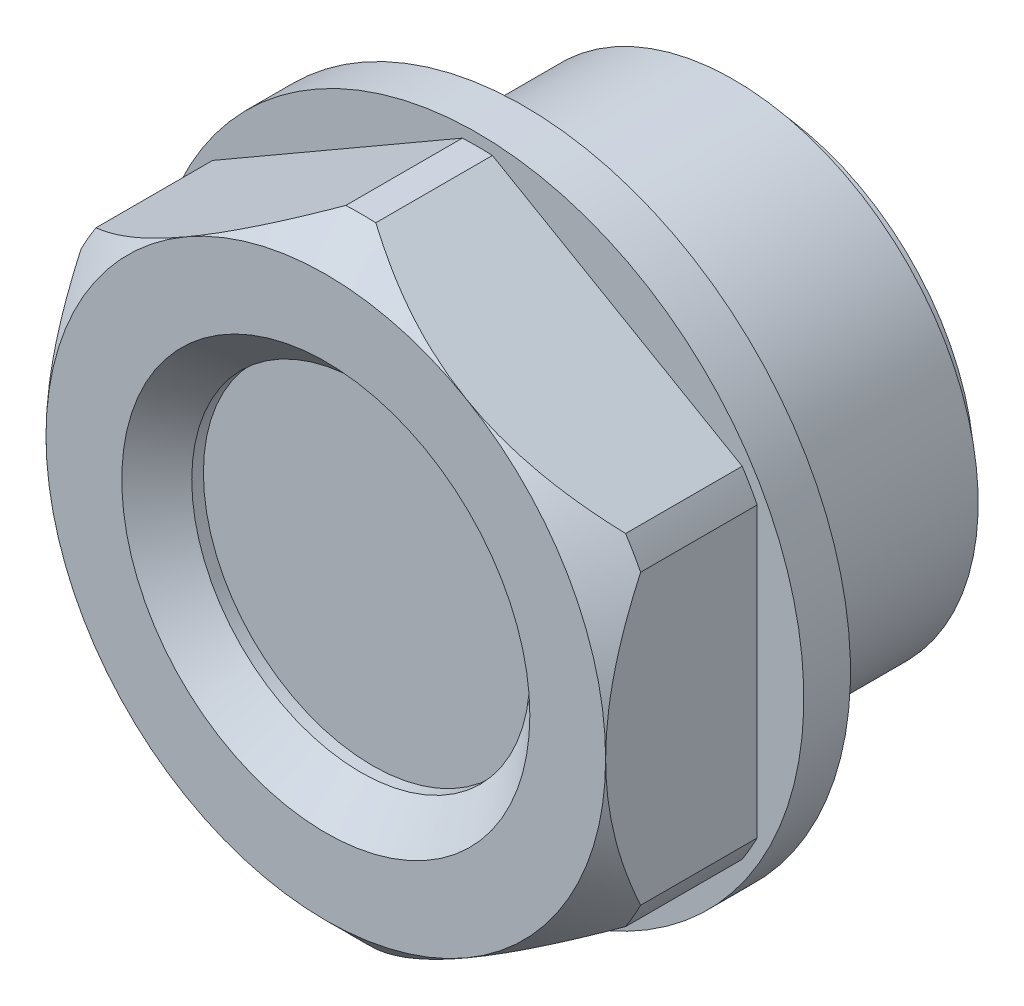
ISO-10303-21;
HEADER;
FILE_DESCRIPTION(('STEP AP214'),'2;1');
FILE_NAME('part.step','',(''),(''),'','','');
FILE_SCHEMA(('AUTOMOTIVE_DESIGN { 1 0 10303 214 1 1 1 1 }'));
ENDSEC;
DATA;
#1=APPLICATION_CONTEXT('core data for automotive mechanical design processes');
#2=APPLICATION_PROTOCOL_DEFINITION('international standard','automotive_design',2000,#1);
#3=PRODUCT_CONTEXT('',#1,'mechanical');
#4=PRODUCT('Part','Part','',(#3));
#5=PRODUCT_RELATED_PRODUCT_CATEGORY('part','',(#4));
#6=PRODUCT_DEFINITION_FORMATION('','',#4);
#7=PRODUCT_DEFINITION_CONTEXT('part definition',#1,'design');
#8=PRODUCT_DEFINITION('design','',#6,#7);
#9=PRODUCT_DEFINITION_SHAPE('','',#8);
#10=(LENGTH_UNIT() NAMED_UNIT(*) SI_UNIT(.MILLI.,.METRE.));
#11=(NAMED_UNIT(*) PLANE_ANGLE_UNIT() SI_UNIT($,.RADIAN.));
#12=(NAMED_UNIT(*) SI_UNIT($,.STERADIAN.) SOLID_ANGLE_UNIT());
#13=UNCERTAINTY_MEASURE_WITH_UNIT(LENGTH_MEASURE(1.E-05),#10,'distance_accuracy_value','');
#14=(GEOMETRIC_REPRESENTATION_CONTEXT(3) GLOBAL_UNCERTAINTY_ASSIGNED_CONTEXT((#13)) GLOBAL_UNIT_ASSIGNED_CONTEXT((#10,
#11,#12)) REPRESENTATION_CONTEXT('',''));
#15=CARTESIAN_POINT('',(0.,0.,0.));
#16=DIRECTION('',(0.,0.,1.));
#17=DIRECTION('',(1.,0.,0.));
#18=AXIS2_PLACEMENT_3D('',#15,#16,#17);
#19=CARTESIAN_POINT('',(0.,0.,0.));
#20=DIRECTION('',(0.,0.,-1.));
#21=DIRECTION('',(-1.,0.,0.));
#22=AXIS2_PLACEMENT_3D('',#19,#20,#21);
#23=CYLINDRICAL_SURFACE('',#22,13.4999999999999);
#24=CARTESIAN_POINT('',(1.50010212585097E-13,1.08246744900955E-13,3.00000000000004));
#25=DIRECTION('',(0.,0.,-1.));
#26=DIRECTION('',(-1.,0.,0.));
#27=AXIS2_PLACEMENT_3D('',#24,#25,#26);
#28=CIRCLE('',#27,13.5);
#29=CARTESIAN_POINT('',(-0.643928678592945,13.4846340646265,2.99999999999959));
#30=VERTEX_POINT('',#29);
#31=CARTESIAN_POINT('',(0.643928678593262,13.4846340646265,2.99999999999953));
#32=VERTEX_POINT('',#31);
#33=EDGE_CURVE('E139',#30,#32,#28,.T.);
#34=ORIENTED_EDGE('',*,*,#33,.F.);
#35=DIRECTION('',(0.,0.,-1.));
#36=VECTOR('',#35,1.);
#37=CARTESIAN_POINT('',(-0.643928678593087,13.4846340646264,-4.54357288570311E-13));
#38=LINE('',#37,#36);
#39=CARTESIAN_POINT('',(-0.643928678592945,13.4846340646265,7.99999999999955));
#40=VERTEX_POINT('',#39);
#41=EDGE_CURVE('E349',#30,#40,#38,.F.);
#42=ORIENTED_EDGE('',*,*,#41,.T.);
#43=CARTESIAN_POINT('',(4.00027233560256E-13,2.88657986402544E-13,8.));
#44=DIRECTION('',(0.,0.,-1.));
#45=DIRECTION('',(-1.,0.,0.));
#46=AXIS2_PLACEMENT_3D('',#43,#44,#45);
#47=CIRCLE('',#46,13.4999999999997);
#48=CARTESIAN_POINT('',(0.643928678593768,13.4846340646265,7.99999999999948));
#49=VERTEX_POINT('',#48);
#50=EDGE_CURVE('E141',#40,#49,#47,.T.);
#51=ORIENTED_EDGE('',*,*,#50,.T.);
#52=DIRECTION('',(0.,0.,-1.));
#53=VECTOR('',#52,1.);
#54=CARTESIAN_POINT('',(0.64392867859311,13.4846340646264,-5.18754540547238E-13));
#55=LINE('',#54,#53);
#56=EDGE_CURVE('E124',#49,#32,#55,.T.);
#57=ORIENTED_EDGE('',*,*,#56,.T.);
#58=EDGE_LOOP('',(#34,#42,#51,#57));
#59=FACE_BOUND('',#58,.T.);
#60=ADVANCED_FACE('F14',(#59),#23,.T.);
#61=CARTESIAN_POINT('',(-11.9999999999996,6.18465843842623,8.00000000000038));
#62=VERTEX_POINT('',#61);
#63=CARTESIAN_POINT('',(-11.3560713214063,7.29997562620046,8.0000000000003));
#64=VERTEX_POINT('',#63);
#65=EDGE_CURVE('E156',#62,#64,#47,.T.);
#66=ORIENTED_EDGE('',*,*,#65,.T.);
#67=DIRECTION('',(0.,0.,-1.));
#68=VECTOR('',#67,1.);
#69=CARTESIAN_POINT('',(-11.356071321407,7.29997562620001,3.04442691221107E-13));
#70=LINE('',#69,#68);
#71=CARTESIAN_POINT('',(-11.3560713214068,7.29997562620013,3.00000000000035));
#72=VERTEX_POINT('',#71);
#73=EDGE_CURVE('E347',#64,#72,#70,.T.);
#74=ORIENTED_EDGE('',*,*,#73,.T.);
#75=CARTESIAN_POINT('',(-11.9999999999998,6.18465843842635,3.00000000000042));
#76=VERTEX_POINT('',#75);
#77=EDGE_CURVE('E148',#76,#72,#28,.T.);
#78=ORIENTED_EDGE('',*,*,#77,.F.);
#79=DIRECTION('',(0.,0.,-1.));
#80=VECTOR('',#79,1.);
#81=CARTESIAN_POINT('',(-12.,6.18465843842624,3.76884468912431E-13));
#82=LINE('',#81,#80);
#83=EDGE_CURVE('E345',#76,#62,#82,.F.);
#84=ORIENTED_EDGE('',*,*,#83,.T.);
#85=EDGE_LOOP('',(#66,#74,#78,#84));
#86=FACE_BOUND('',#85,.T.);
#87=ADVANCED_FACE('F267',(#86),#23,.T.);
#88=CARTESIAN_POINT('',(-11.3560713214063,-7.2999756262,8.00000000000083));
#89=VERTEX_POINT('',#88);
#90=CARTESIAN_POINT('',(-11.9999999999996,-6.18465843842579,8.00000000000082));
#91=VERTEX_POINT('',#90);
#92=EDGE_CURVE('E304',#89,#91,#47,.T.);
#93=ORIENTED_EDGE('',*,*,#92,.T.);
#94=DIRECTION('',(0.,0.,-1.));
#95=VECTOR('',#94,1.);
#96=CARTESIAN_POINT('',(-12.,-6.18465843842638,8.2319723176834E-13));
#97=LINE('',#96,#95);
#98=CARTESIAN_POINT('',(-11.9999999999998,-6.18465843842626,3.00000000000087));
#99=VERTEX_POINT('',#98);
#100=EDGE_CURVE('E30',#91,#99,#97,.T.);
#101=ORIENTED_EDGE('',*,*,#100,.T.);
#102=CARTESIAN_POINT('',(-11.3560713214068,-7.29997562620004,3.00000000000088));
#103=VERTEX_POINT('',#102);
#104=EDGE_CURVE('E152',#103,#99,#28,.T.);
#105=ORIENTED_EDGE('',*,*,#104,.F.);
#106=DIRECTION('',(0.,0.,-1.));
#107=VECTOR('',#106,1.);
#108=CARTESIAN_POINT('',(-11.3560713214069,-7.29997562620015,8.31241757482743E-13));
#109=LINE('',#108,#107);
#110=EDGE_CURVE('E342',#103,#89,#109,.F.);
#111=ORIENTED_EDGE('',*,*,#110,.T.);
#112=EDGE_LOOP('',(#93,#101,#105,#111));
#113=FACE_BOUND('',#112,.T.);
#114=ADVANCED_FACE('F273',(#113),#23,.T.);
#115=CARTESIAN_POINT('',(0.643928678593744,-13.4846340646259,8.00000000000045));
#116=VERTEX_POINT('',#115);
#117=CARTESIAN_POINT('',(-0.643928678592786,-13.4846340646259,8.00000000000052));
#118=VERTEX_POINT('',#117);
#119=EDGE_CURVE('E299',#116,#118,#47,.T.);
#120=ORIENTED_EDGE('',*,*,#119,.T.);
#121=DIRECTION('',(0.,0.,-1.));
#122=VECTOR('',#121,1.);
#123=CARTESIAN_POINT('',(-0.64392867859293,-13.4846340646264,5.1875454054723E-13));
#124=LINE('',#123,#122);
#125=CARTESIAN_POINT('',(-0.64392867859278,-13.4846340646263,3.00000000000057));
#126=VERTEX_POINT('',#125);
#127=EDGE_CURVE('E38',#118,#126,#124,.T.);
#128=ORIENTED_EDGE('',*,*,#127,.T.);
#129=CARTESIAN_POINT('',(0.643928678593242,-13.4846340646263,3.0000000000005));
#130=VERTEX_POINT('',#129);
#131=EDGE_CURVE('E321',#130,#126,#28,.T.);
#132=ORIENTED_EDGE('',*,*,#131,.F.);
#133=DIRECTION('',(0.,0.,-1.));
#134=VECTOR('',#133,1.);
#135=CARTESIAN_POINT('',(0.643928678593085,-13.4846340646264,4.54357288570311E-13));
#136=LINE('',#135,#134);
#137=EDGE_CURVE('E335',#130,#116,#136,.F.);
#138=ORIENTED_EDGE('',*,*,#137,.T.);
#139=EDGE_LOOP('',(#120,#128,#132,#138));
#140=FACE_BOUND('',#139,.T.);
#141=ADVANCED_FACE('F287',(#140),#23,.T.);
#142=CARTESIAN_POINT('',(12.0000000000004,-6.18465843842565,7.99999999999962));
#143=VERTEX_POINT('',#142);
#144=CARTESIAN_POINT('',(11.3560713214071,-7.29997562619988,7.9999999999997));
#145=VERTEX_POINT('',#144);
#146=EDGE_CURVE('E297',#143,#145,#47,.T.);
#147=ORIENTED_EDGE('',*,*,#146,.T.);
#148=DIRECTION('',(0.,0.,-1.));
#149=VECTOR('',#148,1.);
#150=CARTESIAN_POINT('',(11.356071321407,-7.29997562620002,-3.04442691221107E-13));
#151=LINE('',#150,#149);
#152=CARTESIAN_POINT('',(11.3560713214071,-7.29997562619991,2.99999999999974));
#153=VERTEX_POINT('',#152);
#154=EDGE_CURVE('E333',#145,#153,#151,.T.);
#155=ORIENTED_EDGE('',*,*,#154,.T.);
#156=CARTESIAN_POINT('',(12.0000000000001,-6.18465843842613,2.99999999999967));
#157=VERTEX_POINT('',#156);
#158=EDGE_CURVE('E153',#157,#153,#28,.T.);
#159=ORIENTED_EDGE('',*,*,#158,.F.);
#160=DIRECTION('',(0.,0.,-1.));
#161=VECTOR('',#160,1.);
#162=CARTESIAN_POINT('',(12.,-6.18465843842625,-3.7688446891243E-13));
#163=LINE('',#162,#161);
#164=EDGE_CURVE('E332',#157,#143,#163,.F.);
#165=ORIENTED_EDGE('',*,*,#164,.T.);
#166=EDGE_LOOP('',(#147,#155,#159,#165));
#167=FACE_BOUND('',#166,.T.);
#168=ADVANCED_FACE('F277',(#167),#23,.T.);
#169=CARTESIAN_POINT('',(11.356071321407,7.29997562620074,7.99999999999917));
#170=VERTEX_POINT('',#169);
#171=CARTESIAN_POINT('',(12.0000000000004,6.18465843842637,7.99999999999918));
#172=VERTEX_POINT('',#171);
#173=EDGE_CURVE('E292',#170,#172,#47,.T.);
#174=ORIENTED_EDGE('',*,*,#173,.T.);
#175=DIRECTION('',(0.,0.,-1.));
#176=VECTOR('',#175,1.);
#177=CARTESIAN_POINT('',(12.,6.18465843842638,-8.2319723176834E-13));
#178=LINE('',#177,#176);
#179=CARTESIAN_POINT('',(12.0000000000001,6.18465843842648,2.99999999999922));
#180=VERTEX_POINT('',#179);
#181=EDGE_CURVE('E293',#172,#180,#178,.T.);
#182=ORIENTED_EDGE('',*,*,#181,.T.);
#183=CARTESIAN_POINT('',(11.356071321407,7.29997562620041,2.99999999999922));
#184=VERTEX_POINT('',#183);
#185=EDGE_CURVE('E149',#184,#180,#28,.T.);
#186=ORIENTED_EDGE('',*,*,#185,.F.);
#187=DIRECTION('',(0.,0.,-1.));
#188=VECTOR('',#187,1.);
#189=CARTESIAN_POINT('',(11.3560713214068,7.2999756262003,-8.31241757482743E-13));
#190=LINE('',#189,#188);
#191=EDGE_CURVE('E127',#184,#170,#190,.F.);
#192=ORIENTED_EDGE('',*,*,#191,.T.);
#193=EDGE_LOOP('',(#174,#182,#186,#192));
#194=FACE_BOUND('',#193,.T.);
#195=ADVANCED_FACE('F268',(#194),#23,.T.);
#196=CARTESIAN_POINT('',(4.00027233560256E-13,2.88657986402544E-13,8.));
#197=DIRECTION('',(0.,0.,-1.));
#198=DIRECTION('',(-1.,0.,0.));
#199=AXIS2_PLACEMENT_3D('',#196,#197,#198);
#200=CONICAL_SURFACE('',#199,13.4999999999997,0.785398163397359);
#201=ORIENTED_EDGE('',*,*,#50,.F.);
#202=CARTESIAN_POINT('',(-0.643550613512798,13.4848523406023,7.99979999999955));
#203=CARTESIAN_POINT('',(-0.832338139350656,13.3758558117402,8.09965654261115));
#204=CARTESIAN_POINT('',(-1.02246813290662,13.2660842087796,8.19608289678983));
#205=CARTESIAN_POINT('',(-1.40563689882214,13.0448616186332,8.38117000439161));
#206=CARTESIAN_POINT('',(-1.59867693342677,12.9334099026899,8.46982726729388));
#207=CARTESIAN_POINT('',(-2.18372369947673,12.5956329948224,8.72329780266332));
#208=CARTESIAN_POINT('',(-2.58022177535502,12.3667147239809,8.87483476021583));
#209=CARTESIAN_POINT('',(-3.18035308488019,12.0202287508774,9.06810106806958));
#210=CARTESIAN_POINT('',(-3.38000816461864,11.9049578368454,9.12658370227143));
#211=CARTESIAN_POINT('',(-3.78162736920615,11.673082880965,9.23172342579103));
#212=CARTESIAN_POINT('',(-3.98359103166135,11.55647910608,9.27838284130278));
#213=CARTESIAN_POINT('',(-4.38911553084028,11.3223494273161,9.35887901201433));
#214=CARTESIAN_POINT('',(-4.59267345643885,11.2048252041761,9.39273524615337));
#215=CARTESIAN_POINT('',(-5.00113628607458,10.9689990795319,9.44697359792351));
#216=CARTESIAN_POINT('',(-5.20604114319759,10.8506972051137,9.4673561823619));
#217=CARTESIAN_POINT('',(-5.60044581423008,10.6229875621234,9.49311479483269));
#218=CARTESIAN_POINT('',(-5.78989441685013,10.5136093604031,9.4995417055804));
#219=CARTESIAN_POINT('',(-6.16880174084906,10.2948471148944,9.50041090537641));
#220=CARTESIAN_POINT('',(-6.35826046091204,10.1854630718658,9.49485392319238));
#221=CARTESIAN_POINT('',(-6.73672359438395,9.96695727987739,9.47186387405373));
#222=CARTESIAN_POINT('',(-6.92572775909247,9.85783567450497,9.45442535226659));
#223=CARTESIAN_POINT('',(-7.30268302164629,9.64020045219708,9.40802949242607));
#224=CARTESIAN_POINT('',(-7.49063395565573,9.53168692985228,9.3790704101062));
#225=CARTESIAN_POINT('',(-8.05211691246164,9.207514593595,9.27571118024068));
#226=CARTESIAN_POINT('',(-8.42343235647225,8.99313552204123,9.18481901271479));
#227=CARTESIAN_POINT('',(-9.15749760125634,8.56932275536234,8.96504942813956));
#228=CARTESIAN_POINT('',(-9.52024387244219,8.35989109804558,8.83615664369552));
#229=CARTESIAN_POINT('',(-10.0039232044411,8.08063870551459,8.64089120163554));
#230=CARTESIAN_POINT('',(-10.1291221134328,8.00835508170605,8.58817867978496));
#231=CARTESIAN_POINT('',(-10.3782948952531,7.86449510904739,8.47918694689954));
#232=CARTESIAN_POINT('',(-10.5022692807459,7.79291846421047,8.42290930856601));
#233=CARTESIAN_POINT('',(-10.7485844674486,7.65070832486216,8.30725260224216));
#234=CARTESIAN_POINT('',(-10.8709296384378,7.58007230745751,8.24788589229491));
#235=CARTESIAN_POINT('',(-11.1145202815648,7.43943518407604,8.12608148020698));
#236=CARTESIAN_POINT('',(-11.2357653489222,7.36943431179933,8.0636426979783));
#237=CARTESIAN_POINT('',(-11.3564493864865,7.29975735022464,7.9998000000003));
#238=B_SPLINE_CURVE_WITH_KNOTS('',3,(#202,#203,#204,#205,#206,#207,#208,#209,#210,#211,#212,
#213,#214,#215,#216,#217,#218,#219,#220,#221,#222,#223,#224,#225,#226,#227,#228,#229,#230,#231,
#232,#233,#234,#235,#236,#237),.UNSPECIFIED.,.F.,.F.,(4,2,2,2,2,2,2,2,2,2,2,2,2,2,2,2,2,4),(0.,
0.719240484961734,1.4388024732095,2.8834030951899,3.59668947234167,4.30983540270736,
5.0218919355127,5.73392379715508,6.39015337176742,7.04634304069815,7.70283417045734,
8.35942473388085,9.67207668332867,10.9852601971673,11.4468656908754,11.9082689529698,
12.3679502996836,12.8277944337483),.UNSPECIFIED.);
#239=CARTESIAN_POINT('',(-5.99999999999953,10.3923048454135,9.5));
#240=VERTEX_POINT('',#239);
#241=EDGE_CURVE('E9',#40,#240,#238,.T.);
#242=ORIENTED_EDGE('',*,*,#241,.T.);
#243=CARTESIAN_POINT('',(4.75032339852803E-13,3.4278135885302E-13,9.5));
#244=DIRECTION('',(0.,0.,-1.));
#245=DIRECTION('',(-1.,0.,0.));
#246=AXIS2_PLACEMENT_3D('',#243,#244,#245);
#247=CIRCLE('',#246,12.);
#248=CARTESIAN_POINT('',(6.00000000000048,10.3923048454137,9.49999999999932));
#249=VERTEX_POINT('',#248);
#250=EDGE_CURVE('E314',#240,#249,#247,.T.);
#251=ORIENTED_EDGE('',*,*,#250,.T.);
#252=CARTESIAN_POINT('',(11.3564493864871,7.29975735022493,7.99979999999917));
#253=CARTESIAN_POINT('',(11.1676618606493,7.40875387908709,8.09965654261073));
#254=CARTESIAN_POINT('',(10.9775318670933,7.51852548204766,8.19608289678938));
#255=CARTESIAN_POINT('',(10.5943631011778,7.73974807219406,8.38117000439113));
#256=CARTESIAN_POINT('',(10.4013230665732,7.85119978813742,8.46982726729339));
#257=CARTESIAN_POINT('',(9.81627630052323,8.18897669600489,8.7232978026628));
#258=CARTESIAN_POINT('',(9.41977822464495,8.4178949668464,8.87483476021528));
#259=CARTESIAN_POINT('',(8.81964691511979,8.76438093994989,9.06810106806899));
#260=CARTESIAN_POINT('',(8.61999183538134,8.87965185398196,9.12658370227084));
#261=CARTESIAN_POINT('',(8.21837263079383,9.11152680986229,9.23172342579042));
#262=CARTESIAN_POINT('',(8.01640896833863,9.22813058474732,9.27838284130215));
#263=CARTESIAN_POINT('',(7.61088446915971,9.46226026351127,9.35887901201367));
#264=CARTESIAN_POINT('',(7.40732654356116,9.5797844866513,9.39273524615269));
#265=CARTESIAN_POINT('',(6.99886371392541,9.8156106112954,9.44697359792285));
#266=CARTESIAN_POINT('',(6.79395885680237,9.93391248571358,9.46735618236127));
#267=CARTESIAN_POINT('',(6.3995541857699,10.1616221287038,9.49311479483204));
#268=CARTESIAN_POINT('',(6.21010558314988,10.2710003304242,9.49954170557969));
#269=CARTESIAN_POINT('',(5.83119825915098,10.4897625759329,9.50041090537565));
#270=CARTESIAN_POINT('',(5.64173953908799,10.5991466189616,9.49485392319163));
#271=CARTESIAN_POINT('',(5.26327640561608,10.8176524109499,9.47186387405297));
#272=CARTESIAN_POINT('',(5.07427224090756,10.9267740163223,9.45442535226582));
#273=CARTESIAN_POINT('',(4.69731697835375,11.1444092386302,9.40802949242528));
#274=CARTESIAN_POINT('',(4.5093660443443,11.252922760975,9.37907041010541));
#275=CARTESIAN_POINT('',(3.9478830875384,11.5770950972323,9.27571118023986));
#276=CARTESIAN_POINT('',(3.57656764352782,11.7914741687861,9.18481901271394));
#277=CARTESIAN_POINT('',(2.84250239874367,12.2152869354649,8.96504942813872));
#278=CARTESIAN_POINT('',(2.47975612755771,12.4247185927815,8.83615664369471));
#279=CARTESIAN_POINT('',(1.99607679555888,12.7039709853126,8.64089120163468));
#280=CARTESIAN_POINT('',(1.87087788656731,12.7762546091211,8.58817867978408));
#281=CARTESIAN_POINT('',(1.62170510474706,12.9201145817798,8.47918694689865));
#282=CARTESIAN_POINT('',(1.49773071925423,12.9916912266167,8.42290930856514));
#283=CARTESIAN_POINT('',(1.25141553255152,13.133901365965,8.3072526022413));
#284=CARTESIAN_POINT('',(1.12907036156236,13.2045373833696,8.24788589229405));
#285=CARTESIAN_POINT('',(0.885479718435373,13.3451745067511,8.12608148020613));
#286=CARTESIAN_POINT('',(0.764234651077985,13.4151753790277,8.06364269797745));
#287=CARTESIAN_POINT('',(0.643550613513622,13.4848523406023,7.99979999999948));
#288=B_SPLINE_CURVE_WITH_KNOTS('',3,(#252,#253,#254,#255,#256,#257,#258,#259,#260,#261,#262,
#263,#264,#265,#266,#267,#268,#269,#270,#271,#272,#273,#274,#275,#276,#277,#278,#279,#280,#281,
#282,#283,#284,#285,#286,#287),.UNSPECIFIED.,.F.,.F.,(4,2,2,2,2,2,2,2,2,2,2,2,2,2,2,2,2,4),(0.,
0.719240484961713,1.43880247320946,2.88340309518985,3.5966894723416,4.30983540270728,
5.02189193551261,5.73392379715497,6.3901533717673,7.04634304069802,7.70283417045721,
8.35942473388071,9.67207668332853,10.9852601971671,11.4468656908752,11.9082689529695,
12.3679502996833,12.8277944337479),.UNSPECIFIED.);
#289=EDGE_CURVE('E181',#249,#49,#288,.T.);
#290=ORIENTED_EDGE('',*,*,#289,.T.);
#291=EDGE_LOOP('',(#201,#242,#251,#290));
#292=FACE_BOUND('',#291,.T.);
#293=ADVANCED_FACE('F197',(#292),#200,.T.);
#294=CARTESIAN_POINT('',(-11.9999999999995,2.75127143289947E-13,9.5000000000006));
#295=VERTEX_POINT('',#294);
#296=EDGE_CURVE('E309',#295,#240,#247,.T.);
#297=ORIENTED_EDGE('',*,*,#296,.T.);
#298=EDGE_CURVE('E23',#240,#64,#238,.T.);
#299=ORIENTED_EDGE('',*,*,#298,.T.);
#300=ORIENTED_EDGE('',*,*,#65,.F.);
#301=CARTESIAN_POINT('',(-11.9999999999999,-14.3151171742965,2.82053052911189));
#302=CARTESIAN_POINT('',(-11.9999999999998,-13.9687104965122,3.08594145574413));
#303=CARTESIAN_POINT('',(-11.9999999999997,-13.6204211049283,3.34893403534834));
#304=CARTESIAN_POINT('',(-11.9999999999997,-12.9193132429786,3.86898247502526));
#305=CARTESIAN_POINT('',(-11.9999999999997,-12.5664937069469,4.12603689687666));
#306=CARTESIAN_POINT('',(-11.9999999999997,-11.8529821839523,4.63493857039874));
#307=CARTESIAN_POINT('',(-11.9999999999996,-11.4922504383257,4.88673026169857));
#308=CARTESIAN_POINT('',(-11.9999999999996,-10.7647557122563,5.38141487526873));
#309=CARTESIAN_POINT('',(-11.9999999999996,-10.3979931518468,5.62430841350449));
#310=CARTESIAN_POINT('',(-11.9999999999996,-9.63447672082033,6.11390129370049));
#311=CARTESIAN_POINT('',(-11.9999999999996,-9.23727320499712,6.3599029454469));
#312=CARTESIAN_POINT('',(-11.9999999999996,-8.43354849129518,6.8364405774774));
#313=CARTESIAN_POINT('',(-11.9999999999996,-8.0270257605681,7.06697398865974));
#314=CARTESIAN_POINT('',(-11.9999999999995,-7.20458431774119,7.50765099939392));
#315=CARTESIAN_POINT('',(-11.9999999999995,-6.78869794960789,7.71785449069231));
#316=CARTESIAN_POINT('',(-11.9999999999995,-5.94525775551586,8.11316268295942));
#317=CARTESIAN_POINT('',(-11.9999999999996,-5.51770949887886,8.29827912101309));
#318=CARTESIAN_POINT('',(-11.9999999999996,-4.69120241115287,8.62068514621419));
#319=CARTESIAN_POINT('',(-11.9999999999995,-4.29337469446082,8.76084482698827));
#320=CARTESIAN_POINT('',(-11.9999999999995,-3.48770629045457,9.00930734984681));
#321=CARTESIAN_POINT('',(-11.9999999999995,-3.07986495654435,9.11760812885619));
#322=CARTESIAN_POINT('',(-11.9999999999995,-2.26363546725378,9.29473374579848));
#323=CARTESIAN_POINT('',(-11.9999999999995,-1.85540352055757,9.36426641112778));
#324=CARTESIAN_POINT('',(-11.9999999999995,-1.03402392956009,9.46242618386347));
#325=CARTESIAN_POINT('',(-11.9999999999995,-0.620877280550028,9.49106143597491));
#326=CARTESIAN_POINT('',(-11.9999999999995,0.188808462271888,9.50505579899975));
#327=CARTESIAN_POINT('',(-11.9999999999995,0.585317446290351,9.49217936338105));
#328=CARTESIAN_POINT('',(-11.9999999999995,1.37517643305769,9.42788010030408));
#329=CARTESIAN_POINT('',(-11.9999999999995,1.76852614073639,9.37645371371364));
#330=CARTESIAN_POINT('',(-11.9999999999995,2.55588154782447,9.23706542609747));
#331=CARTESIAN_POINT('',(-11.9999999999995,2.94977207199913,9.14846373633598));
#332=CARTESIAN_POINT('',(-11.9999999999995,3.72890133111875,8.93959779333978));
#333=CARTESIAN_POINT('',(-11.9999999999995,4.1141406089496,8.81933553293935));
#334=CARTESIAN_POINT('',(-11.9999999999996,4.90004303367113,8.54368035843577));
#335=CARTESIAN_POINT('',(-11.9999999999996,5.30007537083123,8.38650884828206));
#336=CARTESIAN_POINT('',(-11.9999999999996,6.08983153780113,8.04791230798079));
#337=CARTESIAN_POINT('',(-11.9999999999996,6.47955059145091,7.86647626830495));
#338=CARTESIAN_POINT('',(-11.9999999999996,7.2505331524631,7.48365576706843));
#339=CARTESIAN_POINT('',(-11.9999999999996,7.63176577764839,7.28220961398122));
#340=CARTESIAN_POINT('',(-11.9999999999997,8.3854881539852,6.86380585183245));
#341=CARTESIAN_POINT('',(-11.9999999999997,8.75797924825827,6.64685064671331));
#342=CARTESIAN_POINT('',(-11.9999999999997,9.47713631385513,6.21149668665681));
#343=CARTESIAN_POINT('',(-11.9999999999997,9.82416853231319,5.99369973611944));
#344=CARTESIAN_POINT('',(-11.9999999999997,10.5122714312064,5.54885614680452));
#345=CARTESIAN_POINT('',(-11.9999999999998,10.8533416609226,5.32180881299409));
#346=CARTESIAN_POINT('',(-11.9999999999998,11.5275535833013,4.86196852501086));
#347=CARTESIAN_POINT('',(-11.9999999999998,11.860736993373,4.62923651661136));
#348=CARTESIAN_POINT('',(-11.9999999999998,12.5225361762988,4.15754951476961));
#349=CARTESIAN_POINT('',(-11.9999999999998,12.8511531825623,3.91859625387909));
#350=CARTESIAN_POINT('',(-11.9999999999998,13.1778552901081,3.67709703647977));
#351=B_SPLINE_CURVE_WITH_KNOTS('',3,(#301,#302,#303,#304,#305,#306,#307,#308,#309,#310,#311,
#312,#313,#314,#315,#316,#317,#318,#319,#320,#321,#322,#323,#324,#325,#326,#327,#328,#329,#330,
#331,#332,#333,#334,#335,#336,#337,#338,#339,#340,#341,#342,#343,#344,#345,#346,#347,#348,#349,
#350),.UNSPECIFIED.,.F.,.F.,(4,2,2,2,2,2,2,2,2,2,2,2,2,2,2,2,2,2,2,2,2,2,2,2,4),(0.,
1.30920925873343,2.61873235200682,3.9383708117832,5.25791774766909,6.65927495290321,
8.06086433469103,9.45819013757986,10.8548599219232,12.1191520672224,13.3835260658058,
14.6239884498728,15.864203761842,17.0524098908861,18.2407257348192,19.4503905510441,
20.6599792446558,21.9483906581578,23.2373886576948,24.5304918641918,25.8233950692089,
27.0523698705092,28.2814371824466,29.5006130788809,30.7194530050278),.UNSPECIFIED.);
#352=EDGE_CURVE('E219',#62,#295,#351,.F.);
#353=ORIENTED_EDGE('',*,*,#352,.T.);
#354=EDGE_LOOP('',(#297,#299,#300,#353));
#355=FACE_BOUND('',#354,.T.);
#356=ADVANCED_FACE('F284',(#355),#200,.T.);
#357=CARTESIAN_POINT('',(-5.99999999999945,-10.3923048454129,9.50000000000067));
#358=VERTEX_POINT('',#357);
#359=EDGE_CURVE('E315',#358,#295,#247,.T.);
#360=ORIENTED_EDGE('',*,*,#359,.T.);
#361=EDGE_CURVE('E220',#295,#91,#351,.F.);
#362=ORIENTED_EDGE('',*,*,#361,.T.);
#363=ORIENTED_EDGE('',*,*,#92,.F.);
#364=CARTESIAN_POINT('',(-11.3564493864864,-7.2997573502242,7.99980000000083));
#365=CARTESIAN_POINT('',(-11.1676618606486,-7.40875387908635,8.09965654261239));
#366=CARTESIAN_POINT('',(-10.9775318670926,-7.51852548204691,8.19608289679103));
#367=CARTESIAN_POINT('',(-10.5943631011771,-7.7397480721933,8.38117000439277));
#368=CARTESIAN_POINT('',(-10.4013230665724,-7.85119978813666,8.46982726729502));
#369=CARTESIAN_POINT('',(-9.81627630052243,-8.18897669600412,8.72329780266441));
#370=CARTESIAN_POINT('',(-9.41977822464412,-8.41789496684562,8.87483476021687));
#371=CARTESIAN_POINT('',(-8.81964691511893,-8.7643809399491,9.06810106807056));
#372=CARTESIAN_POINT('',(-8.61999183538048,-8.87965185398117,9.1265837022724));
#373=CARTESIAN_POINT('',(-8.21837263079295,-9.11152680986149,9.23172342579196));
#374=CARTESIAN_POINT('',(-8.01640896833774,-9.22813058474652,9.27838284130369));
#375=CARTESIAN_POINT('',(-7.61088446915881,-9.46226026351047,9.35887901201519));
#376=CARTESIAN_POINT('',(-7.40732654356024,-9.5797844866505,9.39273524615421));
#377=CARTESIAN_POINT('',(-6.99886371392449,-9.81561061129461,9.44697359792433));
#378=CARTESIAN_POINT('',(-6.79395885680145,-9.9339124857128,9.46735618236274));
#379=CARTESIAN_POINT('',(-6.39955418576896,-10.1616221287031,9.49311479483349));
#380=CARTESIAN_POINT('',(-6.21010558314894,-10.2710003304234,9.49954170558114));
#381=CARTESIAN_POINT('',(-5.83119825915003,-10.4897625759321,9.50041090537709));
#382=CARTESIAN_POINT('',(-5.64173953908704,-10.5991466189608,9.49485392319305));
#383=CARTESIAN_POINT('',(-5.26327640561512,-10.8176524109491,9.47186387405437));
#384=CARTESIAN_POINT('',(-5.07427224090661,-10.9267740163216,9.45442535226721));
#385=CARTESIAN_POINT('',(-4.69731697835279,-11.1444092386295,9.40802949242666));
#386=CARTESIAN_POINT('',(-4.50936604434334,-11.2529227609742,9.37907041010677));
#387=CARTESIAN_POINT('',(-3.94788308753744,-11.5770950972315,9.27571118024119));
#388=CARTESIAN_POINT('',(-3.57656764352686,-11.7914741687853,9.18481901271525));
#389=CARTESIAN_POINT('',(-2.84250239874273,-12.2152869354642,8.96504942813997));
#390=CARTESIAN_POINT('',(-2.47975612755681,-12.4247185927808,8.83615664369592));
#391=CARTESIAN_POINT('',(-1.99607679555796,-12.7039709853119,8.64089120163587));
#392=CARTESIAN_POINT('',(-1.87087788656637,-12.7762546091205,8.58817867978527));
#393=CARTESIAN_POINT('',(-1.6217051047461,-12.9201145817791,8.47918694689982));
#394=CARTESIAN_POINT('',(-1.49773071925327,-12.991691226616,8.42290930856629));
#395=CARTESIAN_POINT('',(-1.25141553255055,-13.1339013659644,8.30725260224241));
#396=CARTESIAN_POINT('',(-1.12907036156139,-13.204537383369,8.24788589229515));
#397=CARTESIAN_POINT('',(-0.885479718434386,-13.3451745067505,8.1260814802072));
#398=CARTESIAN_POINT('',(-0.764234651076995,-13.4151753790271,8.06364269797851));
#399=CARTESIAN_POINT('',(-0.643550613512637,-13.4848523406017,7.99980000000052));
#400=B_SPLINE_CURVE_WITH_KNOTS('',3,(#364,#365,#366,#367,#368,#369,#370,#371,#372,#373,#374,
#375,#376,#377,#378,#379,#380,#381,#382,#383,#384,#385,#386,#387,#388,#389,#390,#391,#392,#393,
#394,#395,#396,#397,#398,#399),.UNSPECIFIED.,.F.,.F.,(4,2,2,2,2,2,2,2,2,2,2,2,2,2,2,2,2,4),(0.,
0.719240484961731,1.43880247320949,2.88340309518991,3.59668947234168,4.30983540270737,
5.02189193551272,5.73392379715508,6.39015337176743,7.04634304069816,7.70283417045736,
8.35942473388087,9.67207668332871,10.9852601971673,11.4468656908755,11.9082689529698,
12.3679502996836,12.8277944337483),.UNSPECIFIED.);
#401=EDGE_CURVE('E226',#89,#358,#400,.T.);
#402=ORIENTED_EDGE('',*,*,#401,.T.);
#403=EDGE_LOOP('',(#360,#362,#363,#402));
#404=FACE_BOUND('',#403,.T.);
#405=ADVANCED_FACE('F411',(#404),#200,.T.);
#406=CARTESIAN_POINT('',(6.00000000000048,-10.3923048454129,9.5));
#407=VERTEX_POINT('',#406);
#408=EDGE_CURVE('E351',#407,#358,#247,.T.);
#409=ORIENTED_EDGE('',*,*,#408,.T.);
#410=EDGE_CURVE('E227',#358,#118,#400,.T.);
#411=ORIENTED_EDGE('',*,*,#410,.T.);
#412=ORIENTED_EDGE('',*,*,#119,.F.);
#413=CARTESIAN_POINT('',(0.643550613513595,-13.4848523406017,7.99980000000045));
#414=CARTESIAN_POINT('',(0.832338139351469,-13.3758558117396,8.09965654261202));
#415=CARTESIAN_POINT('',(1.02246813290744,-13.266084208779,8.19608289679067));
#416=CARTESIAN_POINT('',(1.40563689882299,-13.0448616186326,8.3811700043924));
#417=CARTESIAN_POINT('',(1.59867693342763,-12.9334099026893,8.46982726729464));
#418=CARTESIAN_POINT('',(2.18372369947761,-12.5956329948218,8.723297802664));
#419=CARTESIAN_POINT('',(2.58022177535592,-12.3667147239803,8.87483476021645));
#420=CARTESIAN_POINT('',(3.18035308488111,-12.0202287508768,9.06810106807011));
#421=CARTESIAN_POINT('',(3.38000816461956,-11.9049578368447,9.12658370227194));
#422=CARTESIAN_POINT('',(3.78162736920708,-11.6730828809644,9.23172342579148));
#423=CARTESIAN_POINT('',(3.98359103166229,-11.5564791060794,9.2783828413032));
#424=CARTESIAN_POINT('',(4.38911553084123,-11.3223494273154,9.35887901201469));
#425=CARTESIAN_POINT('',(4.5926734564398,-11.2048252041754,9.3927352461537));
#426=CARTESIAN_POINT('',(5.00113628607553,-10.9689990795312,9.44697359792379));
#427=CARTESIAN_POINT('',(5.20604114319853,-10.850697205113,9.46735618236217));
#428=CARTESIAN_POINT('',(5.60044581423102,-10.6229875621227,9.4931147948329));
#429=CARTESIAN_POINT('',(5.78989441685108,-10.5136093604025,9.49954170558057));
#430=CARTESIAN_POINT('',(6.16880174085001,-10.2948471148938,9.50041090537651));
#431=CARTESIAN_POINT('',(6.35826046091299,-10.1854630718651,9.49485392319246));
#432=CARTESIAN_POINT('',(6.7367235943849,-9.96695727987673,9.47186387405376));
#433=CARTESIAN_POINT('',(6.92572775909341,-9.8578356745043,9.4544253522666));
#434=CARTESIAN_POINT('',(7.30268302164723,-9.64020045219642,9.40802949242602));
#435=CARTESIAN_POINT('',(7.49063395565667,-9.53168692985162,9.37907041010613));
#436=CARTESIAN_POINT('',(8.05211691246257,-9.20751459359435,9.27571118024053));
#437=CARTESIAN_POINT('',(8.42343235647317,-8.99313552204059,9.18481901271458));
#438=CARTESIAN_POINT('',(9.15749760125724,-8.5693227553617,8.96504942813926));
#439=CARTESIAN_POINT('',(9.52024387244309,-8.35989109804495,8.83615664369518));
#440=CARTESIAN_POINT('',(10.003923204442,-8.08063870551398,8.64089120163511));
#441=CARTESIAN_POINT('',(10.1291221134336,-8.00835508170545,8.58817867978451));
#442=CARTESIAN_POINT('',(10.3782948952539,-7.86449510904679,8.47918694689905));
#443=CARTESIAN_POINT('',(10.5022692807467,-7.79291846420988,8.42290930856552));
#444=CARTESIAN_POINT('',(10.7485844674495,-7.65070832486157,8.30725260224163));
#445=CARTESIAN_POINT('',(10.8709296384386,-7.58007230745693,8.24788589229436));
#446=CARTESIAN_POINT('',(11.1145202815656,-7.43943518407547,8.1260814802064));
#447=CARTESIAN_POINT('',(11.235765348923,-7.36943431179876,8.0636426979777));
#448=CARTESIAN_POINT('',(11.3564493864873,-7.29975735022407,7.9997999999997));
#449=B_SPLINE_CURVE_WITH_KNOTS('',3,(#413,#414,#415,#416,#417,#418,#419,#420,#421,#422,#423,
#424,#425,#426,#427,#428,#429,#430,#431,#432,#433,#434,#435,#436,#437,#438,#439,#440,#441,#442,
#443,#444,#445,#446,#447,#448),.UNSPECIFIED.,.F.,.F.,(4,2,2,2,2,2,2,2,2,2,2,2,2,2,2,2,2,4),(0.,
0.719240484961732,1.43880247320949,2.8834030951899,3.59668947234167,4.30983540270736,
5.0218919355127,5.73392379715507,6.39015337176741,7.04634304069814,7.70283417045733,
8.35942473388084,9.67207668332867,10.9852601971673,11.4468656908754,11.9082689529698,
12.3679502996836,12.8277944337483),.UNSPECIFIED.);
#450=EDGE_CURVE('E232',#116,#407,#449,.T.);
#451=ORIENTED_EDGE('',*,*,#450,.T.);
#452=EDGE_LOOP('',(#409,#411,#412,#451));
#453=FACE_BOUND('',#452,.T.);
#454=ADVANCED_FACE('F406',(#453),#200,.T.);
#455=CARTESIAN_POINT('',(12.0000000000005,4.08700850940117E-13,9.4999999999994));
#456=VERTEX_POINT('',#455);
#457=EDGE_CURVE('E357',#456,#407,#247,.T.);
#458=ORIENTED_EDGE('',*,*,#457,.T.);
#459=EDGE_CURVE('E233',#407,#145,#449,.T.);
#460=ORIENTED_EDGE('',*,*,#459,.T.);
#461=ORIENTED_EDGE('',*,*,#146,.F.);
#462=CARTESIAN_POINT('',(12.0000000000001,-14.3151171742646,2.82053052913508));
#463=CARTESIAN_POINT('',(12.0000000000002,-13.9687104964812,3.08594145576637));
#464=CARTESIAN_POINT('',(12.0000000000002,-13.6204211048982,3.34893403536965));
#465=CARTESIAN_POINT('',(12.0000000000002,-12.9193132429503,3.86898247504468));
#466=CARTESIAN_POINT('',(12.0000000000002,-12.5664937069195,4.12603689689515));
#467=CARTESIAN_POINT('',(12.0000000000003,-11.8529821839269,4.63493857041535));
#468=CARTESIAN_POINT('',(12.0000000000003,-11.4922504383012,4.88673026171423));
#469=CARTESIAN_POINT('',(12.0000000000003,-10.7647557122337,5.38141487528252));
#470=CARTESIAN_POINT('',(12.0000000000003,-10.3979931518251,5.62430841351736));
#471=CARTESIAN_POINT('',(12.0000000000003,-9.6344767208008,6.11390129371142));
#472=CARTESIAN_POINT('',(12.0000000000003,-9.23727320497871,6.35990294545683));
#473=CARTESIAN_POINT('',(12.0000000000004,-8.43354849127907,6.83644057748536));
#474=CARTESIAN_POINT('',(12.0000000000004,-8.02702576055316,7.06697398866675));
#475=CARTESIAN_POINT('',(12.0000000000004,-7.20458431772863,7.50765099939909));
#476=CARTESIAN_POINT('',(12.0000000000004,-6.78869794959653,7.71785449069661));
#477=CARTESIAN_POINT('',(12.0000000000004,-5.94525775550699,8.11316268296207));
#478=CARTESIAN_POINT('',(12.0000000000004,-5.51770949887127,8.29827912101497));
#479=CARTESIAN_POINT('',(12.0000000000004,-4.69120241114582,8.62068514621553));
#480=CARTESIAN_POINT('',(12.0000000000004,-4.29337469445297,8.76084482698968));
#481=CARTESIAN_POINT('',(12.0000000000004,-3.48770629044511,9.00930734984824));
#482=CARTESIAN_POINT('',(12.0000000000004,-3.07986495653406,9.11760812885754));
#483=CARTESIAN_POINT('',(12.0000000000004,-2.26363546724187,9.29473374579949));
#484=CARTESIAN_POINT('',(12.0000000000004,-1.85540352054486,9.36426641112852));
#485=CARTESIAN_POINT('',(12.0000000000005,-1.03402392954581,9.46242618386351));
#486=CARTESIAN_POINT('',(12.0000000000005,-0.620877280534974,9.4910614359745));
#487=CARTESIAN_POINT('',(12.0000000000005,0.188808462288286,9.50505579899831));
#488=CARTESIAN_POINT('',(12.0000000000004,0.58531744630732,9.49217936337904));
#489=CARTESIAN_POINT('',(12.0000000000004,1.37517643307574,9.42788010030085));
#490=CARTESIAN_POINT('',(12.0000000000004,1.76852614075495,9.37645371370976));
#491=CARTESIAN_POINT('',(12.0000000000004,2.55588154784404,9.23706542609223));
#492=CARTESIAN_POINT('',(12.0000000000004,2.94977207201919,9.14846373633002));
#493=CARTESIAN_POINT('',(12.0000000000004,3.72890133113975,8.93959779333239));
#494=CARTESIAN_POINT('',(12.0000000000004,4.11414060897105,8.81933553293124));
#495=CARTESIAN_POINT('',(12.0000000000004,4.90004303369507,8.54368035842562));
#496=CARTESIAN_POINT('',(12.0000000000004,5.30007537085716,8.38650884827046));
#497=CARTESIAN_POINT('',(12.0000000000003,6.08983153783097,8.04791230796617));
#498=CARTESIAN_POINT('',(12.0000000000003,6.47955059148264,7.86647626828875));
#499=CARTESIAN_POINT('',(12.0000000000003,7.25053315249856,7.48365576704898));
#500=CARTESIAN_POINT('',(12.0000000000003,7.63176577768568,7.28220961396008));
#501=CARTESIAN_POINT('',(12.0000000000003,8.3854881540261,6.86380585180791));
#502=CARTESIAN_POINT('',(12.0000000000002,8.75797924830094,6.64685064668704));
#503=CARTESIAN_POINT('',(12.0000000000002,9.47713631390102,6.21149668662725));
#504=CARTESIAN_POINT('',(12.0000000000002,9.82416853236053,5.99369973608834));
#505=CARTESIAN_POINT('',(12.0000000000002,10.5122714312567,5.54885614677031));
#506=CARTESIAN_POINT('',(12.0000000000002,10.8533416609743,5.32180881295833));
#507=CARTESIAN_POINT('',(12.0000000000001,11.5275535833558,4.86196852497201));
#508=CARTESIAN_POINT('',(12.0000000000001,11.8607369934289,4.62923651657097));
#509=CARTESIAN_POINT('',(12.0000000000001,12.5225361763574,4.15754951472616));
#510=CARTESIAN_POINT('',(12.0000000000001,12.8511531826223,3.91859625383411));
#511=CARTESIAN_POINT('',(12.0000000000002,13.1778552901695,3.67709703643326));
#512=B_SPLINE_CURVE_WITH_KNOTS('',3,(#462,#463,#464,#465,#466,#467,#468,#469,#470,#471,#472,
#473,#474,#475,#476,#477,#478,#479,#480,#481,#482,#483,#484,#485,#486,#487,#488,#489,#490,#491,
#492,#493,#494,#495,#496,#497,#498,#499,#500,#501,#502,#503,#504,#505,#506,#507,#508,#509,#510,
#511),.UNSPECIFIED.,.F.,.F.,(4,2,2,2,2,2,2,2,2,2,2,2,2,2,2,2,2,2,2,2,2,2,2,2,4),(0.,
1.30920925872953,2.61873235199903,3.93837081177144,5.25791774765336,6.65927495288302,
8.06086433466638,9.45819013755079,10.8548599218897,12.1191520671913,13.383526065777,
14.6239884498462,15.8642037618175,17.0524098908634,18.2407257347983,19.4503905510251,
20.6599792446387,21.9483906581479,23.237388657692,24.5304918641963,25.8233950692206,
27.052369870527,28.2814371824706,29.5006130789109,30.719453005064),.UNSPECIFIED.);
#513=EDGE_CURVE('E635',#143,#456,#512,.T.);
#514=ORIENTED_EDGE('',*,*,#513,.T.);
#515=EDGE_LOOP('',(#458,#460,#461,#514));
#516=FACE_BOUND('',#515,.T.);
#517=ADVANCED_FACE('F401',(#516),#200,.T.);
#518=EDGE_CURVE('E362',#249,#456,#247,.T.);
#519=ORIENTED_EDGE('',*,*,#518,.T.);
#520=EDGE_CURVE('E190',#456,#172,#512,.T.);
#521=ORIENTED_EDGE('',*,*,#520,.T.);
#522=ORIENTED_EDGE('',*,*,#173,.F.);
#523=EDGE_CURVE('E189',#170,#249,#288,.T.);
#524=ORIENTED_EDGE('',*,*,#523,.T.);
#525=EDGE_LOOP('',(#519,#521,#522,#524));
#526=FACE_BOUND('',#525,.T.);
#527=ADVANCED_FACE('F286',(#526),#200,.T.);
#528=CARTESIAN_POINT('',(4.75032339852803E-13,-11.9999999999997,9.50000000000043));
#529=DIRECTION('',(0.,0.,1.));
#530=DIRECTION('',(1.,0.,0.));
#531=AXIS2_PLACEMENT_3D('',#528,#529,#530);
#532=PLANE('',#531);
#533=CARTESIAN_POINT('',(7.0704616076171E-13,0.,9.5));
#534=DIRECTION('',(0.,0.,1.));
#535=DIRECTION('',(1.,0.,0.));
#536=AXIS2_PLACEMENT_3D('',#533,#534,#535);
#537=CIRCLE('',#536,8.75000000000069);
#538=CARTESIAN_POINT('',(8.7500000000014,0.,9.49999999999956));
#539=VERTEX_POINT('',#538);
#540=EDGE_CURVE('E18',#539,#539,#537,.T.);
#541=ORIENTED_EDGE('',*,*,#540,.F.);
#542=EDGE_LOOP('',(#541));
#543=FACE_BOUND('',#542,.T.);
#544=ORIENTED_EDGE('',*,*,#296,.F.);
#545=ORIENTED_EDGE('',*,*,#359,.F.);
#546=ORIENTED_EDGE('',*,*,#408,.F.);
#547=ORIENTED_EDGE('',*,*,#457,.F.);
#548=ORIENTED_EDGE('',*,*,#518,.F.);
#549=ORIENTED_EDGE('',*,*,#250,.F.);
#550=EDGE_LOOP('',(#544,#545,#546,#547,#548,#549));
#551=FACE_BOUND('',#550,.T.);
#552=ADVANCED_FACE('F16',(#543,#551),#532,.T.);
#553=CARTESIAN_POINT('',(-4.50030637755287E-13,-9.31550000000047,-8.99999999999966));
#554=DIRECTION('',(0.,0.,-1.));
#555=DIRECTION('',(-1.,0.,0.));
#556=AXIS2_PLACEMENT_3D('',#553,#554,#555);
#557=PLANE('',#556);
#558=CARTESIAN_POINT('',(-4.50030637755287E-13,-3.24740234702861E-13,-9.));
#559=DIRECTION('',(0.,0.,-1.));
#560=DIRECTION('',(-1.,0.,0.));
#561=AXIS2_PLACEMENT_3D('',#558,#559,#560);
#562=CIRCLE('',#561,9.31550000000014);
#563=CARTESIAN_POINT('',(-9.31550000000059,-3.24740234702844E-13,-8.99999999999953));
#564=VERTEX_POINT('',#563);
#565=EDGE_CURVE('E178',#564,#564,#562,.T.);
#566=ORIENTED_EDGE('',*,*,#565,.T.);
#567=EDGE_LOOP('',(#566));
#568=FACE_BOUND('',#567,.T.);
#569=ADVANCED_FACE('F393',(#568),#557,.T.);
#570=CARTESIAN_POINT('',(0.,0.,0.));
#571=DIRECTION('',(0.,0.,-1.));
#572=DIRECTION('',(-1.,0.,0.));
#573=AXIS2_PLACEMENT_3D('',#570,#571,#572);
#574=CYLINDRICAL_SURFACE('',#573,9.31550000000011);
#575=CARTESIAN_POINT('',(-4.00027233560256E-13,-2.88657986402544E-13,-8.));
#576=DIRECTION('',(0.,0.,-1.));
#577=DIRECTION('',(-1.,0.,0.));
#578=AXIS2_PLACEMENT_3D('',#575,#576,#577);
#579=CIRCLE('',#578,9.3155);
#580=CARTESIAN_POINT('',(-9.3155000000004,-2.88657986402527E-13,-7.99999999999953));
#581=VERTEX_POINT('',#580);
#582=EDGE_CURVE('E175',#581,#581,#579,.T.);
#583=ORIENTED_EDGE('',*,*,#582,.T.);
#584=EDGE_LOOP('',(#583));
#585=FACE_BOUND('',#584,.T.);
#586=ORIENTED_EDGE('',*,*,#565,.F.);
#587=EDGE_LOOP('',(#586));
#588=FACE_BOUND('',#587,.T.);
#589=ADVANCED_FACE('F399',(#585,#588),#574,.T.);
#590=CARTESIAN_POINT('',(-4.00027233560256E-13,-10.4775000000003,-7.99999999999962));
#591=DIRECTION('',(0.,0.,-1.));
#592=DIRECTION('',(-1.,0.,0.));
#593=AXIS2_PLACEMENT_3D('',#590,#591,#592);
#594=PLANE('',#593);
#595=CARTESIAN_POINT('',(-4.00027233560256E-13,-2.88657986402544E-13,-8.));
#596=DIRECTION('',(0.,0.,-1.));
#597=DIRECTION('',(-1.,0.,0.));
#598=AXIS2_PLACEMENT_3D('',#595,#596,#597);
#599=CIRCLE('',#598,10.4775);
#600=CARTESIAN_POINT('',(-10.4775000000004,-2.88657986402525E-13,-7.99999999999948));
#601=VERTEX_POINT('',#600);
#602=EDGE_CURVE('E172',#601,#601,#599,.T.);
#603=ORIENTED_EDGE('',*,*,#602,.T.);
#604=EDGE_LOOP('',(#603));
#605=FACE_BOUND('',#604,.T.);
#606=ORIENTED_EDGE('',*,*,#582,.F.);
#607=EDGE_LOOP('',(#606));
#608=FACE_BOUND('',#607,.T.);
#609=ADVANCED_FACE('F478',(#605,#608),#594,.T.);
#610=CARTESIAN_POINT('',(0.,0.,0.));
#611=DIRECTION('',(0.,0.,-1.));
#612=DIRECTION('',(-1.,0.,0.));
#613=AXIS2_PLACEMENT_3D('',#610,#611,#612);
#614=CYLINDRICAL_SURFACE('',#613,10.4775);
#615=CARTESIAN_POINT('',(0.,0.,0.));
#616=DIRECTION('',(0.,0.,-1.));
#617=DIRECTION('',(-1.,0.,0.));
#618=AXIS2_PLACEMENT_3D('',#615,#616,#617);
#619=CIRCLE('',#618,10.4775);
#620=CARTESIAN_POINT('',(-10.4775,0.,5.97074701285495E-13));
#621=VERTEX_POINT('',#620);
#622=EDGE_CURVE('E169',#621,#621,#619,.T.);
#623=ORIENTED_EDGE('',*,*,#622,.T.);
#624=EDGE_LOOP('',(#623));
#625=FACE_BOUND('',#624,.T.);
#626=ORIENTED_EDGE('',*,*,#602,.F.);
#627=EDGE_LOOP('',(#626));
#628=FACE_BOUND('',#627,.T.);
#629=ADVANCED_FACE('F487',(#625,#628),#614,.T.);
#630=CARTESIAN_POINT('',(0.,-12.3,5.29702144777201E-13));
#631=DIRECTION('',(0.,0.,-1.));
#632=DIRECTION('',(-1.,0.,0.));
#633=AXIS2_PLACEMENT_3D('',#630,#631,#632);
#634=PLANE('',#633);
#635=CARTESIAN_POINT('',(0.,0.,0.));
#636=DIRECTION('',(0.,0.,-1.));
#637=DIRECTION('',(-1.,0.,0.));
#638=AXIS2_PLACEMENT_3D('',#635,#636,#637);
#639=CIRCLE('',#638,12.3);
#640=CARTESIAN_POINT('',(-12.3,0.,7.00932362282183E-13));
#641=VERTEX_POINT('',#640);
#642=EDGE_CURVE('E166',#641,#641,#639,.T.);
#643=ORIENTED_EDGE('',*,*,#642,.T.);
#644=EDGE_LOOP('',(#643));
#645=FACE_BOUND('',#644,.T.);
#646=ORIENTED_EDGE('',*,*,#622,.F.);
#647=EDGE_LOOP('',(#646));
#648=FACE_BOUND('',#647,.T.);
#649=ADVANCED_FACE('F496',(#645,#648),#634,.T.);
#650=CARTESIAN_POINT('',(0.,0.,0.));
#651=DIRECTION('',(0.,0.,-1.));
#652=DIRECTION('',(-1.,0.,0.));
#653=AXIS2_PLACEMENT_3D('',#650,#651,#652);
#654=CYLINDRICAL_SURFACE('',#653,12.3);
#655=CARTESIAN_POINT('',(0.,0.,1.00000000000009));
#656=DIRECTION('',(0.,0.,-1.));
#657=DIRECTION('',(-1.,0.,0.));
#658=AXIS2_PLACEMENT_3D('',#655,#656,#657);
#659=CIRCLE('',#658,12.3);
#660=CARTESIAN_POINT('',(-12.2999999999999,0.,1.0000000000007));
#661=VERTEX_POINT('',#660);
#662=EDGE_CURVE('E163',#661,#661,#659,.T.);
#663=ORIENTED_EDGE('',*,*,#662,.T.);
#664=EDGE_LOOP('',(#663));
#665=FACE_BOUND('',#664,.T.);
#666=ORIENTED_EDGE('',*,*,#642,.F.);
#667=EDGE_LOOP('',(#666));
#668=FACE_BOUND('',#667,.T.);
#669=ADVANCED_FACE('F505',(#665,#668),#654,.T.);
#670=CARTESIAN_POINT('',(0.,-13.5,1.00000000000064));
#671=DIRECTION('',(0.,0.,-1.));
#672=DIRECTION('',(-1.,0.,0.));
#673=AXIS2_PLACEMENT_3D('',#670,#671,#672);
#674=PLANE('',#673);
#675=CARTESIAN_POINT('',(0.,0.,1.00000000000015));
#676=DIRECTION('',(0.,0.,-1.));
#677=DIRECTION('',(-1.,0.,0.));
#678=AXIS2_PLACEMENT_3D('',#675,#676,#677);
#679=CIRCLE('',#678,14.);
#680=CARTESIAN_POINT('',(-14.,0.,1.00000000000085));
#681=VERTEX_POINT('',#680);
#682=EDGE_CURVE('E160',#681,#681,#679,.T.);
#683=ORIENTED_EDGE('',*,*,#682,.T.);
#684=EDGE_LOOP('',(#683));
#685=FACE_BOUND('',#684,.T.);
#686=ORIENTED_EDGE('',*,*,#662,.F.);
#687=EDGE_LOOP('',(#686));
#688=FACE_BOUND('',#687,.T.);
#689=ADVANCED_FACE('F514',(#685,#688),#674,.T.);
#690=CARTESIAN_POINT('',(0.,0.,0.));
#691=DIRECTION('',(0.,0.,-1.));
#692=DIRECTION('',(-1.,0.,0.));
#693=AXIS2_PLACEMENT_3D('',#690,#691,#692);
#694=CYLINDRICAL_SURFACE('',#693,14.);
#695=CARTESIAN_POINT('',(1.50010212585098E-13,1.08246744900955E-13,3.00000000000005));
#696=DIRECTION('',(0.,0.,-1.));
#697=DIRECTION('',(-1.,0.,0.));
#698=AXIS2_PLACEMENT_3D('',#695,#696,#697);
#699=CIRCLE('',#698,14.);
#700=CARTESIAN_POINT('',(-13.9999999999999,1.08246744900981E-13,3.00000000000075));
#701=VERTEX_POINT('',#700);
#702=EDGE_CURVE('E151',#701,#701,#699,.T.);
#703=ORIENTED_EDGE('',*,*,#702,.T.);
#704=EDGE_LOOP('',(#703));
#705=FACE_BOUND('',#704,.T.);
#706=ORIENTED_EDGE('',*,*,#682,.F.);
#707=EDGE_LOOP('',(#706));
#708=FACE_BOUND('',#707,.T.);
#709=ADVANCED_FACE('F523',(#705,#708),#694,.T.);
#710=CARTESIAN_POINT('',(1.50010212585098E-13,-14.,3.00000000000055));
#711=DIRECTION('',(0.,0.,1.));
#712=DIRECTION('',(1.,0.,0.));
#713=AXIS2_PLACEMENT_3D('',#710,#711,#712);
#714=PLANE('',#713);
#715=DIRECTION('',(0.866025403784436,0.5,0.));
#716=VECTOR('',#715,1.);
#717=CARTESIAN_POINT('',(1.50858644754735E-13,13.8564064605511,2.99999999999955));
#718=LINE('',#717,#716);
#719=EDGE_CURVE('E133',#72,#30,#718,.T.);
#720=ORIENTED_EDGE('',*,*,#719,.T.);
#721=ORIENTED_EDGE('',*,*,#33,.T.);
#722=DIRECTION('',(0.866025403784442,-0.5,0.));
#723=VECTOR('',#722,1.);
#724=CARTESIAN_POINT('',(12.0000000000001,6.92820323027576,2.9999999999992));
#725=LINE('',#724,#723);
#726=EDGE_CURVE('E121',#32,#184,#725,.T.);
#727=ORIENTED_EDGE('',*,*,#726,.T.);
#728=ORIENTED_EDGE('',*,*,#185,.T.);
#729=DIRECTION('',(0.,-1.,0.));
#730=VECTOR('',#729,1.);
#731=CARTESIAN_POINT('',(12.0000000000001,-6.92820323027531,2.9999999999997));
#732=LINE('',#731,#730);
#733=EDGE_CURVE('E132',#180,#157,#732,.T.);
#734=ORIENTED_EDGE('',*,*,#733,.T.);
#735=ORIENTED_EDGE('',*,*,#158,.T.);
#736=DIRECTION('',(-0.866025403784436,-0.5,0.));
#737=VECTOR('',#736,1.);
#738=CARTESIAN_POINT('',(2.30891694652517E-13,-13.8564064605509,3.00000000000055));
#739=LINE('',#738,#737);
#740=EDGE_CURVE('E331',#153,#130,#739,.T.);
#741=ORIENTED_EDGE('',*,*,#740,.T.);
#742=ORIENTED_EDGE('',*,*,#131,.T.);
#743=DIRECTION('',(-0.866025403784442,0.5,0.));
#744=VECTOR('',#743,1.);
#745=CARTESIAN_POINT('',(-11.9999999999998,-6.92820323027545,3.0000000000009));
#746=LINE('',#745,#744);
#747=EDGE_CURVE('E374',#126,#103,#746,.T.);
#748=ORIENTED_EDGE('',*,*,#747,.T.);
#749=ORIENTED_EDGE('',*,*,#104,.T.);
#750=DIRECTION('',(0.,1.,0.));
#751=VECTOR('',#750,1.);
#752=CARTESIAN_POINT('',(-11.9999999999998,6.92820323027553,3.0000000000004));
#753=LINE('',#752,#751);
#754=EDGE_CURVE('E142',#99,#76,#753,.T.);
#755=ORIENTED_EDGE('',*,*,#754,.T.);
#756=ORIENTED_EDGE('',*,*,#77,.T.);
#757=EDGE_LOOP('',(#720,#721,#727,#728,#734,#735,#741,#742,#748,#749,#755,#756));
#758=FACE_BOUND('',#757,.T.);
#759=ORIENTED_EDGE('',*,*,#702,.F.);
#760=EDGE_LOOP('',(#759));
#761=FACE_BOUND('',#760,.T.);
#762=ADVANCED_FACE('F145',(#758,#761),#714,.T.);
#763=CARTESIAN_POINT('',(11.9999999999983,6.92820323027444,-33.6606055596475));
#764=DIRECTION('',(0.5,0.866025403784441,0.));
#765=DIRECTION('',(-0.866025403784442,0.5,0.));
#766=AXIS2_PLACEMENT_3D('',#763,#764,#765);
#767=PLANE('',#766);
#768=ORIENTED_EDGE('',*,*,#726,.F.);
#769=ORIENTED_EDGE('',*,*,#56,.F.);
#770=ORIENTED_EDGE('',*,*,#289,.F.);
#771=ORIENTED_EDGE('',*,*,#523,.F.);
#772=ORIENTED_EDGE('',*,*,#191,.F.);
#773=EDGE_LOOP('',(#768,#769,#770,#771,#772));
#774=FACE_BOUND('',#773,.T.);
#775=ADVANCED_FACE('F123',(#774),#767,.T.);
#776=CARTESIAN_POINT('',(11.9999999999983,-6.92820323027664,-33.660605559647));
#777=DIRECTION('',(1.,0.,0.));
#778=DIRECTION('',(0.,1.,0.));
#779=AXIS2_PLACEMENT_3D('',#776,#777,#778);
#780=PLANE('',#779);
#781=ORIENTED_EDGE('',*,*,#733,.F.);
#782=ORIENTED_EDGE('',*,*,#181,.F.);
#783=ORIENTED_EDGE('',*,*,#520,.F.);
#784=ORIENTED_EDGE('',*,*,#513,.F.);
#785=ORIENTED_EDGE('',*,*,#164,.F.);
#786=EDGE_LOOP('',(#781,#782,#783,#784,#785));
#787=FACE_BOUND('',#786,.T.);
#788=ADVANCED_FACE('F203',(#787),#780,.T.);
#789=CARTESIAN_POINT('',(-1.60226338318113E-12,-13.8564064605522,-33.6606055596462));
#790=DIRECTION('',(0.5,-0.866025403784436,0.));
#791=DIRECTION('',(0.866025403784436,0.5,0.));
#792=AXIS2_PLACEMENT_3D('',#789,#790,#791);
#793=PLANE('',#792);
#794=ORIENTED_EDGE('',*,*,#740,.F.);
#795=ORIENTED_EDGE('',*,*,#154,.F.);
#796=ORIENTED_EDGE('',*,*,#459,.F.);
#797=ORIENTED_EDGE('',*,*,#450,.F.);
#798=ORIENTED_EDGE('',*,*,#137,.F.);
#799=EDGE_LOOP('',(#794,#795,#796,#797,#798));
#800=FACE_BOUND('',#799,.T.);
#801=ADVANCED_FACE('F242',(#800),#793,.T.);
#802=CARTESIAN_POINT('',(-12.0000000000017,-6.92820323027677,-33.6606055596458));
#803=DIRECTION('',(-0.5,-0.866025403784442,0.));
#804=DIRECTION('',(0.866025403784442,-0.5,0.));
#805=AXIS2_PLACEMENT_3D('',#802,#803,#804);
#806=PLANE('',#805);
#807=ORIENTED_EDGE('',*,*,#747,.F.);
#808=ORIENTED_EDGE('',*,*,#127,.F.);
#809=ORIENTED_EDGE('',*,*,#410,.F.);
#810=ORIENTED_EDGE('',*,*,#401,.F.);
#811=ORIENTED_EDGE('',*,*,#110,.F.);
#812=EDGE_LOOP('',(#807,#808,#809,#810,#811));
#813=FACE_BOUND('',#812,.T.);
#814=ADVANCED_FACE('F239',(#813),#806,.T.);
#815=CARTESIAN_POINT('',(-12.0000000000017,6.92820323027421,-33.6606055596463));
#816=DIRECTION('',(-1.,0.,0.));
#817=DIRECTION('',(0.,-1.,0.));
#818=AXIS2_PLACEMENT_3D('',#815,#816,#817);
#819=PLANE('',#818);
#820=ORIENTED_EDGE('',*,*,#754,.F.);
#821=ORIENTED_EDGE('',*,*,#100,.F.);
#822=ORIENTED_EDGE('',*,*,#361,.F.);
#823=ORIENTED_EDGE('',*,*,#352,.F.);
#824=ORIENTED_EDGE('',*,*,#83,.F.);
#825=EDGE_LOOP('',(#820,#821,#822,#823,#824));
#826=FACE_BOUND('',#825,.T.);
#827=ADVANCED_FACE('F209',(#826),#819,.T.);
#828=CARTESIAN_POINT('',(-1.68229643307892E-12,13.8564064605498,-33.6606055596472));
#829=DIRECTION('',(-0.5,0.866025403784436,0.));
#830=DIRECTION('',(-0.866025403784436,-0.5,0.));
#831=AXIS2_PLACEMENT_3D('',#828,#829,#830);
#832=PLANE('',#831);
#833=ORIENTED_EDGE('',*,*,#719,.F.);
#834=ORIENTED_EDGE('',*,*,#73,.F.);
#835=ORIENTED_EDGE('',*,*,#298,.F.);
#836=ORIENTED_EDGE('',*,*,#241,.F.);
#837=ORIENTED_EDGE('',*,*,#41,.F.);
#838=EDGE_LOOP('',(#833,#834,#835,#836,#837));
#839=FACE_BOUND('',#838,.T.);
#840=ADVANCED_FACE('F204',(#839),#832,.T.);
#841=CARTESIAN_POINT('',(0.,0.,7.49999999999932));
#842=DIRECTION('',(0.,0.,-1.));
#843=DIRECTION('',(-1.,0.,0.));
#844=AXIS2_PLACEMENT_3D('',#841,#842,#843);
#845=PLANE('',#844);
#846=CARTESIAN_POINT('',(0.,0.,7.49999999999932));
#847=DIRECTION('',(0.,0.,-1.));
#848=DIRECTION('',(-1.,0.,0.));
#849=AXIS2_PLACEMENT_3D('',#846,#847,#848);
#850=CIRCLE('',#849,7.25);
#851=CARTESIAN_POINT('',(-7.25,0.,7.49999999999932));
#852=VERTEX_POINT('',#851);
#853=EDGE_CURVE('E378',#852,#852,#850,.T.);
#854=ORIENTED_EDGE('',*,*,#853,.F.);
#855=EDGE_LOOP('',(#854));
#856=FACE_BOUND('',#855,.T.);
#857=ADVANCED_FACE('F208',(#856),#845,.F.);
#858=CARTESIAN_POINT('',(0.,0.,-12.2576655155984));
#859=DIRECTION('',(0.,0.,-1.));
#860=DIRECTION('',(-1.,0.,0.));
#861=AXIS2_PLACEMENT_3D('',#858,#859,#860);
#862=CYLINDRICAL_SURFACE('',#861,7.25);
#863=CARTESIAN_POINT('',(0.,0.,7.99999999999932));
#864=DIRECTION('',(0.,0.,-1.));
#865=DIRECTION('',(-1.,0.,0.));
#866=AXIS2_PLACEMENT_3D('',#863,#864,#865);
#867=CIRCLE('',#866,7.25);
#868=CARTESIAN_POINT('',(-7.25,0.,7.99999999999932));
#869=VERTEX_POINT('',#868);
#870=EDGE_CURVE('E386',#869,#869,#867,.T.);
#871=ORIENTED_EDGE('',*,*,#870,.F.);
#872=EDGE_LOOP('',(#871));
#873=FACE_BOUND('',#872,.T.);
#874=ORIENTED_EDGE('',*,*,#853,.T.);
#875=EDGE_LOOP('',(#874));
#876=FACE_BOUND('',#875,.T.);
#877=ADVANCED_FACE('F252',(#873,#876),#862,.F.);
#878=CARTESIAN_POINT('',(0.,0.,7.99999999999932));
#879=DIRECTION('',(0.,0.,1.));
#880=DIRECTION('',(1.,0.,0.));
#881=AXIS2_PLACEMENT_3D('',#878,#879,#880);
#882=CONICAL_SURFACE('',#881,7.25,0.785398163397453);
#883=ORIENTED_EDGE('',*,*,#540,.T.);
#884=EDGE_LOOP('',(#883));
#885=FACE_BOUND('',#884,.T.);
#886=ORIENTED_EDGE('',*,*,#870,.T.);
#887=EDGE_LOOP('',(#886));
#888=FACE_BOUND('',#887,.T.);
#889=ADVANCED_FACE('F256',(#885,#888),#882,.F.);
#890=CLOSED_SHELL('',(#60,#87,#114,#141,#168,#195,#293,#356,#405,#454,#517,#527,#552,#569,#589,
#609,#629,#649,#669,#689,#709,#762,#775,#788,#801,#814,#827,#840,#857,#877,#889));
#891=MANIFOLD_SOLID_BREP('B1',#890);
#892=ADVANCED_BREP_SHAPE_REPRESENTATION('',(#18,#891),#14);
#893=SHAPE_DEFINITION_REPRESENTATION(#9,#892);
ENDSEC;
END-ISO-10303-21;
